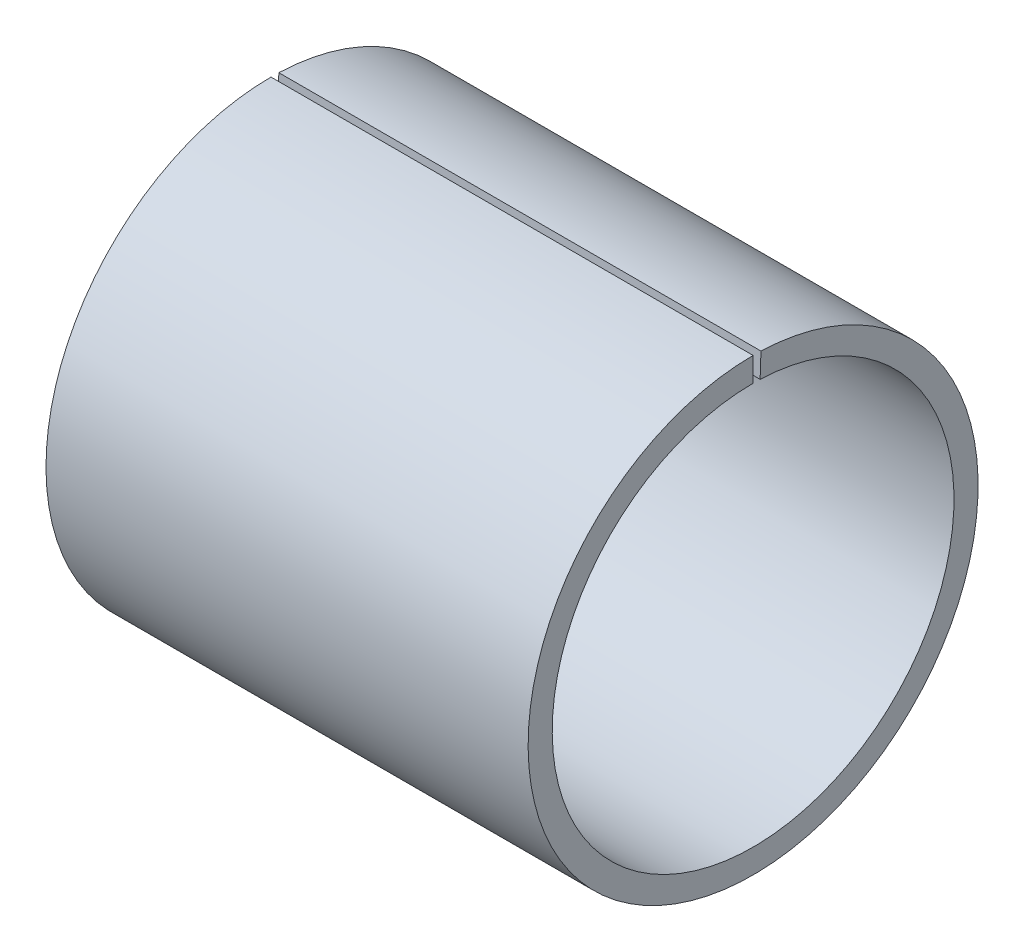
from build123d import *

# Parameters (mm, degrees)
ESQUISSE1_W           = 30
ESQUISSE1_H           = 1.5
BASE_R_VOLUTION_ANGLE = 358


with BuildPart() as part:
    # Esquisse1 → Base-R_volution (revolve)
    with BuildSketch(Plane.XY):
        with Locations((15, 13.25)):
            Rectangle(ESQUISSE1_W, ESQUISSE1_H)
    revolve(axis=Axis((0, 0, 0), (1, 0, 0)), revolution_arc=BASE_R_VOLUTION_ANGLE)


solid = part.part
